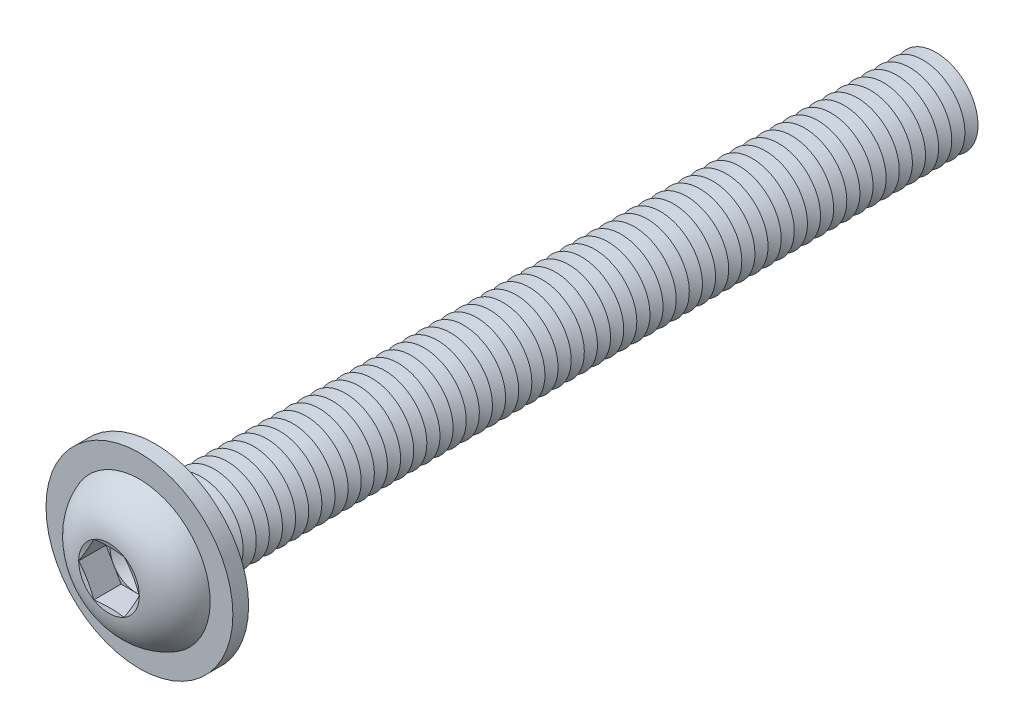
from build123d import *

# Parameters (mm, degrees)
FILLET1_R           = 0.625
LPATTERN1_COUNT     = 60
LPATTERN1_PITCH     = 1.25
CUT_EXTRUDE1_DEPTH  = 2.6
SKETCH5_R           = 8.9
SKETCH5_R_2         = 4.625
BOSS_EXTRUDE1_DEPTH = 1.5


with BuildPart() as part:
    # Sketch1 → Revolve1 (revolve)
    with BuildSketch(Plane(origin=(0, 0, 0), x_dir=(0, 0, -1), z_dir=(1, 0, 0))):
        with BuildLine():
            Line((0, 4), (0, 7))
            ThreePointArc((0, 7), (-3.011595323, 5.81154966), (-4.4, 2.88675))
            Line((-4.4, 2.88675), (-4.013248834, 1.443375))
            Line((-4.013248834, 1.443375), (-4.4, 1.443375))
            Line((-4.4, 1.443375), (-4.4, 0))
            Line((-4.4, 0), (75, 0))
            Line((75, 0), (75, 4))
            Line((75, 4), (0, 4))
        make_face()
    revolve(axis=Axis((0, 0, -75), (0, 0, 1)))

    # Fillet1
    fillet1_edges = [part.edges().sort_by_distance(p)[0] for p in [
        (0, -4, 0),
    ]]
    fillet(fillet1_edges, radius=FILLET1_R)

    # Sketch2 → Cut-Revolve1 (revolve, cut)
    with BuildSketch(Plane(origin=(0, 0, 0), x_dir=(0, 0, -1), z_dir=(1, 0, 0))):
        Polygon((74.375, 4), (75.625, 4), (75, 2.917468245), align=None)
    cut_revolve1 = revolve(axis=Axis((0, 0, -75), (0, 0, -1)), mode=Mode.SUBTRACT)

    # LPattern1: Cut-Revolve1 ×60
    with Locations(*[(0, 0, i * LPATTERN1_PITCH) for i in range(1, LPATTERN1_COUNT)]):
        add(cut_revolve1, mode=Mode.SUBTRACT)

    # Sketch3 → Cut-Extrude1 (cut)
    with BuildSketch(Plane.XY.offset(4.4)):
        Polygon((1.443375, 2.499998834), (-1.443375, 2.499998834), (-2.88675, 0), (-1.443375, -2.499998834), (1.443375, -2.499998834), (2.88675, 0), align=None)
    extrude(amount=-CUT_EXTRUDE1_DEPTH, mode=Mode.SUBTRACT)

    # Cut-Extrude2 cone 1 section (on through the dimple's axis) → Cut-Extrude2 (revolve, cut)
    with BuildSketch(Plane(origin=(0, 0, 1.8), x_dir=(0, -1, 0), z_dir=(1, 0, 0))):
        Polygon((0, 0), (2.499998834, 0), (0, 1.443375), align=None)
    revolve(axis=Axis((0, 0, 1.8), (0, 0, -1)), mode=Mode.SUBTRACT)

    # Sketch5 → Boss-Extrude1 (add)
    with BuildSketch(Plane(origin=(0, 0, 0), x_dir=(-1, 0, 0), z_dir=(0, 0, -1))):
        with Locations(Location((0, 0, 0), (0, 0, 90))):
            Circle(SKETCH5_R)
        Circle(SKETCH5_R_2, mode=Mode.SUBTRACT)
    extrude(amount=-BOSS_EXTRUDE1_DEPTH)


solid = part.part
